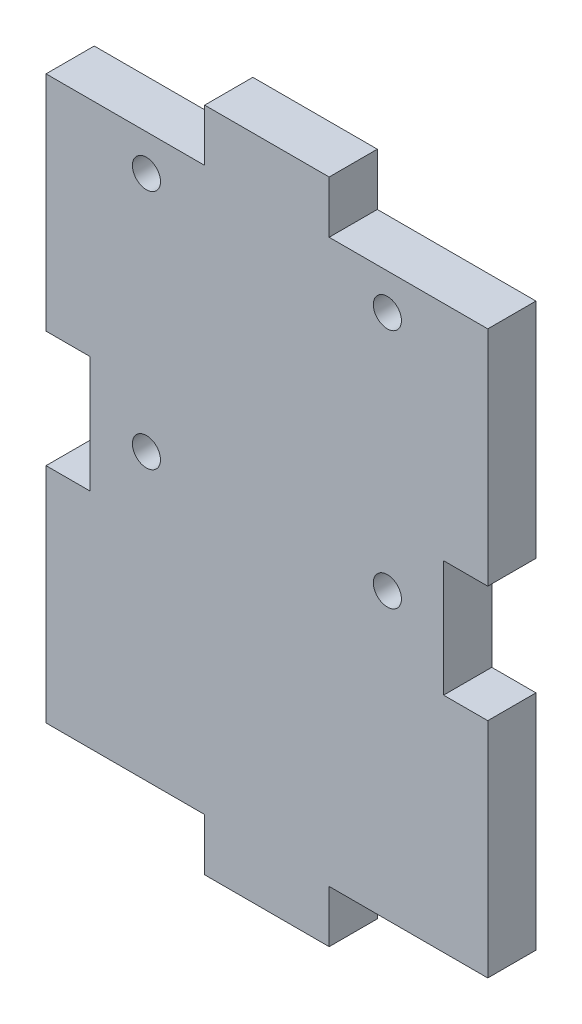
from build123d import *

# Parameters (mm, degrees)
BOSS_EXTRUDE1_DEPTH     = 6
CUT_EXTRUDE1_DEPTH      = 51.144790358
CUT_EXTRUDE1_DEPTH_BACK = 51.144790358
SKETCH2_R               = 1.75


with BuildPart() as part:
    # Sketch1 → Boss-Extrude1 (new body)
    with BuildSketch(Plane.XY):
        Polygon((-27.5, -35), (-7.75, -35), (-7.75, -41.5), (7.75, -41.5), (7.75, -35), (27.5, -35), (27.5, -7.25), (22, -7.25), (22, 7.25), (27.5, 7.25), (27.5, 35), (7.75, 35), (7.75, 41.5), (-7.75, 41.5), (-7.75, 35), (-27.5, 35), (-27.5, 7.25), (-22, 7.25), (-22, -7.25), (-27.5, -7.25), align=None)
    extrude(amount=BOSS_EXTRUDE1_DEPTH)

    # Sketch2 → Cut-Extrude1 (cut, two sides: drawn at the far end of the back side and taken through both)
    with BuildSketch(Plane.XY.offset(6).offset(-CUT_EXTRUDE1_DEPTH_BACK)):
        with Locations((-15, 30.5)):
            Circle(SKETCH2_R)
        with Locations((15, 30.5)):
            Circle(SKETCH2_R)
        with Locations((15, 0.5)):
            Circle(SKETCH2_R)
        with Locations((-15, 0.5)):
            Circle(SKETCH2_R)
    extrude(amount=CUT_EXTRUDE1_DEPTH + CUT_EXTRUDE1_DEPTH_BACK, mode=Mode.SUBTRACT)


solid = part.part
